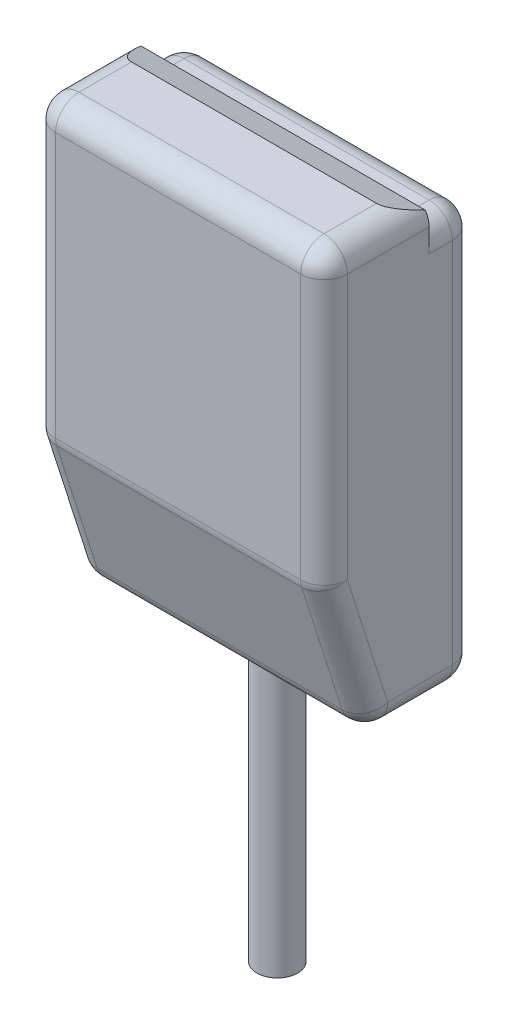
from build123d import *

# Parameters (mm, degrees)
EXTRUSION1_DEPTH = 50
ESQUISSE2_R      = 3.5
EXTRUSION2_DEPTH = 50
CONG_1_R         = 4
CONG_2_R         = 4


with BuildPart() as part:
    # Esquisse1 → Extrusion1 (new body)
    with BuildSketch(Plane(origin=(0, 0, 0), x_dir=(0, 0, -1), z_dir=(1, 0, 0))):
        with BuildLine():
            Line((-4, 0), (-15.080190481, 0))
            ThreePointArc((-15.080190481, 0), (-17.438536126, 0.769178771), (-18.889887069, 2.780897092))
            Line((-18.889887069, 2.780897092), (-25.809696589, 24.40530184))
            ThreePointArc((-25.809696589, 24.40530184), (-25.952137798, 25.007471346), (-26, 25.624404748))
            Line((-26, 25.624404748), (-26, 71))
            ThreePointArc((-26, 71), (-24.828427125, 73.828427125), (-22, 75))
            Line((-22, 75), (-13, 75))
            Line((-13, 75), (-8, 73.180148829))
            Line((-8, 73.180148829), (-8, 71))
            Line((-8, 71), (-4, 71))
            ThreePointArc((-4, 71), (-1.171572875, 69.828427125), (0, 67))
            Line((0, 67), (0, 4))
            ThreePointArc((0, 4), (-1.171572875, 1.171572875), (-4, 0))
        make_face()
    extrude(amount=EXTRUSION1_DEPTH)

    # Esquisse2 → Extrusion2 (add)
    with BuildSketch(Plane.XZ):
        with Locations(Location((25, 9, 0), (0, 0, 90))):
            Circle(ESQUISSE2_R)
    extrude(amount=EXTRUSION2_DEPTH)

    # Cong_1
    cong_1_edges = [part.edges().sort_by_distance(p)[0] for p in [
        (50, 71, 6),
        (50, 69.828427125, 1.171572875),
        (50, 35.5, 0),
        (50, 1.171572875, 1.171572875),
        (50, 0, 9.54009524),
        (50, 0.769178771, 17.438536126),
        (50, 13.593099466, 22.349791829),
        (50, 25.007471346, 25.952137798),
        (50, 48.312202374, 26),
        (50, 73.828427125, 24.828427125),
        (50, 75, 17.5),
    ]]
    fillet(cong_1_edges, radius=CONG_1_R)

    # Cong_2
    cong_2_edges = [part.edges().sort_by_distance(p)[0] for p in [
        (0, 75, 17.5),
        (0, 73.828427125, 24.828427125),
        (0, 71, 6),
        (0, 69.828427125, 1.171572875),
        (0, 35.5, 0),
        (0, 1.171572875, 1.171572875),
        (0, 0, 9.54009524),
        (0, 0.769178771, 17.438536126),
        (0, 13.593099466, 22.349791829),
        (0, 25.007471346, 25.952137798),
        (0, 48.312202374, 26),
    ]]
    fillet(cong_2_edges, radius=CONG_2_R)


solid = part.part
